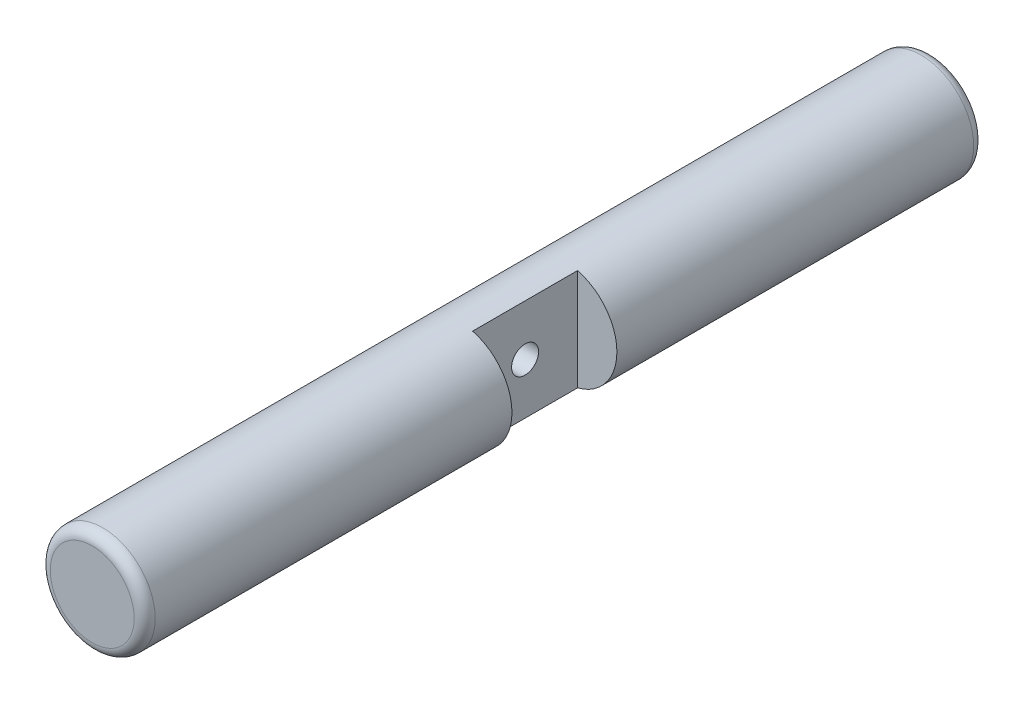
from build123d import *

# Parameters (mm, degrees)
SKETCH1_R                                        = 12.7
BOSS_EXTRUDE1_DEPTH                              = 101.6
CUT_EXTRUDE1_DEPTH                               = 12.7
CSK_FOR_1_4_FLAT_HEAD_MACHINE_SCREW1_D           = 6.5278
CSK_FOR_1_4_FLAT_HEAD_MACHINE_SCREW1_CSINK_D     = 15.0857712
CSK_FOR_1_4_FLAT_HEAD_MACHINE_SCREW1_CSINK_ANGLE = 82
FILLET1_R                                        = 2.54


with BuildPart() as part:
    # Sketch1 → Boss-Extrude1 (new, symmetric)
    with BuildSketch(Plane.XY):
        Circle(SKETCH1_R)
    extrude(amount=BOSS_EXTRUDE1_DEPTH, both=True)

    # Sketch2 → Cut-Extrude1 (cut, symmetric)
    with BuildSketch(Plane.XY):
        with BuildLine():
            Line((3.175, 12.296722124), (3.175, -12.296722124))
            ThreePointArc((3.175, -12.296722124), (12.7, 0), (3.175, 12.296722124))
        make_face()
    extrude(amount=CUT_EXTRUDE1_DEPTH, both=True, mode=Mode.SUBTRACT)

    # CSK for 1_4 Flat Head Machine Screw1 (through all)
    with Locations(Plane(origin=(-12.7, 0, 0), x_dir=(0, 0, -1), z_dir=(-1, 0, 0))):
        with Locations((0, 0)):
            CounterSinkHole(CSK_FOR_1_4_FLAT_HEAD_MACHINE_SCREW1_D / 2, CSK_FOR_1_4_FLAT_HEAD_MACHINE_SCREW1_CSINK_D / 2, counter_sink_angle=CSK_FOR_1_4_FLAT_HEAD_MACHINE_SCREW1_CSINK_ANGLE)

    # Fillet1
    fillet1_edges = [part.edges().sort_by_distance(p)[0] for p in [
        (-12.7, 0, -101.6),
        (-12.7, 0, 101.6),
    ]]
    fillet(fillet1_edges, radius=FILLET1_R)


solid = part.part
